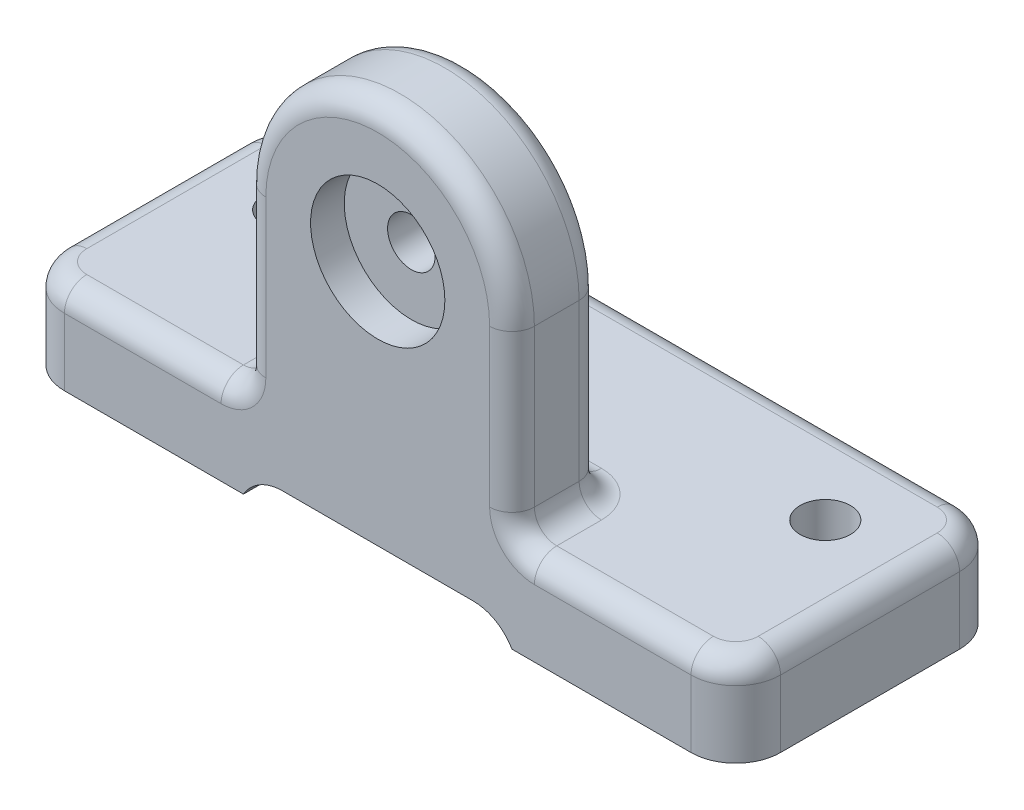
ISO-10303-21;
HEADER;
FILE_DESCRIPTION(('STEP AP214'),'2;1');
FILE_NAME('part.step','',(''),(''),'','','');
FILE_SCHEMA(('AUTOMOTIVE_DESIGN { 1 0 10303 214 1 1 1 1 }'));
ENDSEC;
DATA;
#1=APPLICATION_CONTEXT('core data for automotive mechanical design processes');
#2=APPLICATION_PROTOCOL_DEFINITION('international standard','automotive_design',2000,#1);
#3=PRODUCT_CONTEXT('',#1,'mechanical');
#4=PRODUCT('Part','Part','',(#3));
#5=PRODUCT_RELATED_PRODUCT_CATEGORY('part','',(#4));
#6=PRODUCT_DEFINITION_FORMATION('','',#4);
#7=PRODUCT_DEFINITION_CONTEXT('part definition',#1,'design');
#8=PRODUCT_DEFINITION('design','',#6,#7);
#9=PRODUCT_DEFINITION_SHAPE('','',#8);
#10=(LENGTH_UNIT() NAMED_UNIT(*) SI_UNIT(.MILLI.,.METRE.));
#11=(NAMED_UNIT(*) PLANE_ANGLE_UNIT() SI_UNIT($,.RADIAN.));
#12=(NAMED_UNIT(*) SI_UNIT($,.STERADIAN.) SOLID_ANGLE_UNIT());
#13=UNCERTAINTY_MEASURE_WITH_UNIT(LENGTH_MEASURE(1.E-05),#10,'distance_accuracy_value','');
#14=(GEOMETRIC_REPRESENTATION_CONTEXT(3) GLOBAL_UNCERTAINTY_ASSIGNED_CONTEXT((#13)) GLOBAL_UNIT_ASSIGNED_CONTEXT((#10,
#11,#12)) REPRESENTATION_CONTEXT('',''));
#15=CARTESIAN_POINT('',(0.,0.,0.));
#16=DIRECTION('',(0.,0.,1.));
#17=DIRECTION('',(1.,0.,0.));
#18=AXIS2_PLACEMENT_3D('',#15,#16,#17);
#19=CARTESIAN_POINT('',(0.,0.,-38.1));
#20=DIRECTION('',(0.,-1.,0.));
#21=DIRECTION('',(0.,0.,-1.));
#22=AXIS2_PLACEMENT_3D('',#19,#20,#21);
#23=PLANE('',#22);
#24=DIRECTION('',(-1.,0.,0.));
#25=VECTOR('',#24,1.);
#26=CARTESIAN_POINT('',(0.,0.,-38.1));
#27=LINE('',#26,#25);
#28=CARTESIAN_POINT('',(95.25,0.,-38.1));
#29=VERTEX_POINT('',#28);
#30=CARTESIAN_POINT('',(69.85,0.,-38.1));
#31=VERTEX_POINT('',#30);
#32=EDGE_CURVE('E270',#29,#31,#27,.T.);
#33=ORIENTED_EDGE('',*,*,#32,.F.);
#34=CARTESIAN_POINT('',(95.25,0.,-31.75));
#35=DIRECTION('',(0.,-1.,0.));
#36=DIRECTION('',(0.,0.,-1.));
#37=AXIS2_PLACEMENT_3D('',#34,#35,#36);
#38=CIRCLE('',#37,6.35);
#39=CARTESIAN_POINT('',(101.6,0.,-31.75));
#40=VERTEX_POINT('',#39);
#41=EDGE_CURVE('E298',#29,#40,#38,.T.);
#42=ORIENTED_EDGE('',*,*,#41,.T.);
#43=DIRECTION('',(0.,0.,-1.));
#44=VECTOR('',#43,1.);
#45=CARTESIAN_POINT('',(101.6,0.,0.));
#46=LINE('',#45,#44);
#47=CARTESIAN_POINT('',(101.6,0.,-6.35));
#48=VERTEX_POINT('',#47);
#49=EDGE_CURVE('E233',#48,#40,#46,.T.);
#50=ORIENTED_EDGE('',*,*,#49,.F.);
#51=CARTESIAN_POINT('',(95.25,0.,-6.35));
#52=DIRECTION('',(0.,-1.,0.));
#53=DIRECTION('',(0.,0.,-1.));
#54=AXIS2_PLACEMENT_3D('',#51,#52,#53);
#55=CIRCLE('',#54,6.35);
#56=CARTESIAN_POINT('',(95.25,0.,0.));
#57=VERTEX_POINT('',#56);
#58=EDGE_CURVE('E296',#48,#57,#55,.T.);
#59=ORIENTED_EDGE('',*,*,#58,.T.);
#60=DIRECTION('',(1.,0.,0.));
#61=VECTOR('',#60,1.);
#62=CARTESIAN_POINT('',(0.,0.,0.));
#63=LINE('',#62,#61);
#64=CARTESIAN_POINT('',(69.85,0.,0.));
#65=VERTEX_POINT('',#64);
#66=EDGE_CURVE('E234',#65,#57,#63,.T.);
#67=ORIENTED_EDGE('',*,*,#66,.F.);
#68=DIRECTION('',(0.,0.,1.));
#69=VECTOR('',#68,1.);
#70=CARTESIAN_POINT('',(69.85,0.,-38.1));
#71=LINE('',#70,#69);
#72=EDGE_CURVE('E241',#31,#65,#71,.T.);
#73=ORIENTED_EDGE('',*,*,#72,.F.);
#74=EDGE_LOOP('',(#33,#42,#50,#59,#67,#73));
#75=FACE_BOUND('',#74,.T.);
#76=CARTESIAN_POINT('',(88.9,0.,-25.4));
#77=DIRECTION('',(0.,1.,0.));
#78=DIRECTION('',(0.,0.,1.));
#79=AXIS2_PLACEMENT_3D('',#76,#77,#78);
#80=CIRCLE('',#79,3.571875);
#81=CARTESIAN_POINT('',(88.9,0.,-21.828125));
#82=VERTEX_POINT('',#81);
#83=EDGE_CURVE('E442',#82,#82,#80,.T.);
#84=ORIENTED_EDGE('',*,*,#83,.T.);
#85=EDGE_LOOP('',(#84));
#86=FACE_BOUND('',#85,.T.);
#87=ADVANCED_FACE('F30',(#75,#86),#23,.T.);
#88=CARTESIAN_POINT('',(6.35,0.,0.));
#89=VERTEX_POINT('',#88);
#90=CARTESIAN_POINT('',(31.75,0.,0.));
#91=VERTEX_POINT('',#90);
#92=EDGE_CURVE('E227',#89,#91,#63,.T.);
#93=ORIENTED_EDGE('',*,*,#92,.F.);
#94=CARTESIAN_POINT('',(6.35,0.,-6.35));
#95=DIRECTION('',(0.,-1.,0.));
#96=DIRECTION('',(0.,0.,-1.));
#97=AXIS2_PLACEMENT_3D('',#94,#95,#96);
#98=CIRCLE('',#97,6.35);
#99=CARTESIAN_POINT('',(0.,0.,-6.35));
#100=VERTEX_POINT('',#99);
#101=EDGE_CURVE('E284',#89,#100,#98,.T.);
#102=ORIENTED_EDGE('',*,*,#101,.T.);
#103=DIRECTION('',(0.,0.,1.));
#104=VECTOR('',#103,1.);
#105=CARTESIAN_POINT('',(0.,0.,0.));
#106=LINE('',#105,#104);
#107=CARTESIAN_POINT('',(0.,0.,-31.75));
#108=VERTEX_POINT('',#107);
#109=EDGE_CURVE('E263',#108,#100,#106,.T.);
#110=ORIENTED_EDGE('',*,*,#109,.F.);
#111=CARTESIAN_POINT('',(6.35,0.,-31.75));
#112=DIRECTION('',(0.,-1.,0.));
#113=DIRECTION('',(0.,0.,-1.));
#114=AXIS2_PLACEMENT_3D('',#111,#112,#113);
#115=CIRCLE('',#114,6.35);
#116=CARTESIAN_POINT('',(6.35,0.,-38.1));
#117=VERTEX_POINT('',#116);
#118=EDGE_CURVE('E282',#108,#117,#115,.T.);
#119=ORIENTED_EDGE('',*,*,#118,.T.);
#120=CARTESIAN_POINT('',(31.75,0.,-38.1));
#121=VERTEX_POINT('',#120);
#122=EDGE_CURVE('E240',#121,#117,#27,.T.);
#123=ORIENTED_EDGE('',*,*,#122,.F.);
#124=DIRECTION('',(0.,0.,1.));
#125=VECTOR('',#124,1.);
#126=CARTESIAN_POINT('',(31.75,0.,-38.1));
#127=LINE('',#126,#125);
#128=EDGE_CURVE('E218',#121,#91,#127,.T.);
#129=ORIENTED_EDGE('',*,*,#128,.T.);
#130=EDGE_LOOP('',(#93,#102,#110,#119,#123,#129));
#131=FACE_BOUND('',#130,.T.);
#132=CARTESIAN_POINT('',(12.7,0.,-25.4));
#133=DIRECTION('',(0.,1.,0.));
#134=DIRECTION('',(0.,0.,1.));
#135=AXIS2_PLACEMENT_3D('',#132,#133,#134);
#136=CIRCLE('',#135,3.571875);
#137=CARTESIAN_POINT('',(12.7,0.,-21.828125));
#138=VERTEX_POINT('',#137);
#139=EDGE_CURVE('E448',#138,#138,#136,.T.);
#140=ORIENTED_EDGE('',*,*,#139,.T.);
#141=EDGE_LOOP('',(#140));
#142=FACE_BOUND('',#141,.T.);
#143=ADVANCED_FACE('F237',(#131,#142),#23,.T.);
#144=CARTESIAN_POINT('',(0.,12.7,0.));
#145=DIRECTION('',(1.,0.,0.));
#146=DIRECTION('',(0.,0.,-1.));
#147=AXIS2_PLACEMENT_3D('',#144,#145,#146);
#148=PLANE('',#147);
#149=DIRECTION('',(0.,-1.,0.));
#150=VECTOR('',#149,1.);
#151=CARTESIAN_POINT('',(0.,12.7,-6.35));
#152=LINE('',#151,#150);
#153=CARTESIAN_POINT('',(0.,9.525,-6.35));
#154=VERTEX_POINT('',#153);
#155=EDGE_CURVE('E288',#100,#154,#152,.F.);
#156=ORIENTED_EDGE('',*,*,#155,.T.);
#157=DIRECTION('',(0.,0.,1.));
#158=VECTOR('',#157,1.);
#159=CARTESIAN_POINT('',(0.,9.525,0.));
#160=LINE('',#159,#158);
#161=CARTESIAN_POINT('',(0.,9.525,-31.75));
#162=VERTEX_POINT('',#161);
#163=EDGE_CURVE('E343',#154,#162,#160,.F.);
#164=ORIENTED_EDGE('',*,*,#163,.T.);
#165=DIRECTION('',(0.,-1.,0.));
#166=VECTOR('',#165,1.);
#167=CARTESIAN_POINT('',(0.,12.7,-31.75));
#168=LINE('',#167,#166);
#169=EDGE_CURVE('E286',#162,#108,#168,.T.);
#170=ORIENTED_EDGE('',*,*,#169,.T.);
#171=ORIENTED_EDGE('',*,*,#109,.T.);
#172=EDGE_LOOP('',(#156,#164,#170,#171));
#173=FACE_BOUND('',#172,.T.);
#174=ADVANCED_FACE('F32',(#173),#148,.F.);
#175=CARTESIAN_POINT('',(0.,12.7,0.));
#176=DIRECTION('',(0.,0.,-1.));
#177=DIRECTION('',(-1.,0.,0.));
#178=AXIS2_PLACEMENT_3D('',#175,#176,#177);
#179=PLANE('',#178);
#180=CARTESIAN_POINT('',(50.8,38.1,0.));
#181=DIRECTION('',(0.,0.,1.));
#182=DIRECTION('',(1.,0.,0.));
#183=AXIS2_PLACEMENT_3D('',#180,#181,#182);
#184=CIRCLE('',#183,9.52499999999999);
#185=CARTESIAN_POINT('',(60.325,38.1,0.));
#186=VERTEX_POINT('',#185);
#187=EDGE_CURVE('E256',#186,#186,#184,.T.);
#188=ORIENTED_EDGE('',*,*,#187,.F.);
#189=EDGE_LOOP('',(#188));
#190=FACE_BOUND('',#189,.T.);
#191=CARTESIAN_POINT('',(28.575,15.875,0.));
#192=DIRECTION('',(0.,0.,-1.));
#193=DIRECTION('',(-1.,0.,0.));
#194=AXIS2_PLACEMENT_3D('',#191,#192,#193);
#195=CIRCLE('',#194,6.35);
#196=CARTESIAN_POINT('',(28.575,9.525,0.));
#197=VERTEX_POINT('',#196);
#198=CARTESIAN_POINT('',(34.925,15.875,0.));
#199=VERTEX_POINT('',#198);
#200=EDGE_CURVE('E362',#197,#199,#195,.F.);
#201=ORIENTED_EDGE('',*,*,#200,.F.);
#202=DIRECTION('',(1.,0.,0.));
#203=VECTOR('',#202,1.);
#204=CARTESIAN_POINT('',(0.,9.525,0.));
#205=LINE('',#204,#203);
#206=CARTESIAN_POINT('',(6.35,9.525,0.));
#207=VERTEX_POINT('',#206);
#208=EDGE_CURVE('E365',#197,#207,#205,.F.);
#209=ORIENTED_EDGE('',*,*,#208,.T.);
#210=DIRECTION('',(0.,-1.,0.));
#211=VECTOR('',#210,1.);
#212=CARTESIAN_POINT('',(6.35,12.7,0.));
#213=LINE('',#212,#211);
#214=EDGE_CURVE('E230',#207,#89,#213,.T.);
#215=ORIENTED_EDGE('',*,*,#214,.T.);
#216=ORIENTED_EDGE('',*,*,#92,.T.);
#217=CARTESIAN_POINT('',(37.2492613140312,-3.175,0.));
#218=DIRECTION('',(0.,0.,-1.));
#219=DIRECTION('',(-1.,0.,0.));
#220=AXIS2_PLACEMENT_3D('',#217,#218,#219);
#221=CIRCLE('',#220,6.35);
#222=CARTESIAN_POINT('',(37.2492613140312,3.175,0.));
#223=VERTEX_POINT('',#222);
#224=EDGE_CURVE('E213',#91,#223,#221,.T.);
#225=ORIENTED_EDGE('',*,*,#224,.T.);
#226=DIRECTION('',(-1.,0.,0.));
#227=VECTOR('',#226,1.);
#228=CARTESIAN_POINT('',(31.75,3.175,0.));
#229=LINE('',#228,#227);
#230=CARTESIAN_POINT('',(64.3507386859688,3.175,0.));
#231=VERTEX_POINT('',#230);
#232=EDGE_CURVE('E248',#231,#223,#229,.T.);
#233=ORIENTED_EDGE('',*,*,#232,.F.);
#234=CARTESIAN_POINT('',(64.3507386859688,-3.175,0.));
#235=DIRECTION('',(0.,0.,-1.));
#236=DIRECTION('',(-1.,0.,0.));
#237=AXIS2_PLACEMENT_3D('',#234,#235,#236);
#238=CIRCLE('',#237,6.35);
#239=EDGE_CURVE('E305',#231,#65,#238,.T.);
#240=ORIENTED_EDGE('',*,*,#239,.T.);
#241=ORIENTED_EDGE('',*,*,#66,.T.);
#242=DIRECTION('',(0.,-1.,0.));
#243=VECTOR('',#242,1.);
#244=CARTESIAN_POINT('',(95.25,12.7,0.));
#245=LINE('',#244,#243);
#246=CARTESIAN_POINT('',(95.25,9.525,0.));
#247=VERTEX_POINT('',#246);
#248=EDGE_CURVE('E278',#57,#247,#245,.F.);
#249=ORIENTED_EDGE('',*,*,#248,.T.);
#250=DIRECTION('',(1.,0.,0.));
#251=VECTOR('',#250,1.);
#252=CARTESIAN_POINT('',(0.,9.525,0.));
#253=LINE('',#252,#251);
#254=CARTESIAN_POINT('',(73.025,9.525,0.));
#255=VERTEX_POINT('',#254);
#256=EDGE_CURVE('E360',#247,#255,#253,.F.);
#257=ORIENTED_EDGE('',*,*,#256,.T.);
#258=CARTESIAN_POINT('',(73.025,15.875,0.));
#259=DIRECTION('',(0.,0.,-1.));
#260=DIRECTION('',(-1.,0.,0.));
#261=AXIS2_PLACEMENT_3D('',#258,#259,#260);
#262=CIRCLE('',#261,6.35);
#263=CARTESIAN_POINT('',(66.675,15.875,0.));
#264=VERTEX_POINT('',#263);
#265=EDGE_CURVE('E357',#264,#255,#262,.F.);
#266=ORIENTED_EDGE('',*,*,#265,.F.);
#267=DIRECTION('',(0.,1.,0.));
#268=VECTOR('',#267,1.);
#269=CARTESIAN_POINT('',(66.675,38.1,0.));
#270=LINE('',#269,#268);
#271=CARTESIAN_POINT('',(66.675,38.1,0.));
#272=VERTEX_POINT('',#271);
#273=EDGE_CURVE('E355',#264,#272,#270,.T.);
#274=ORIENTED_EDGE('',*,*,#273,.T.);
#275=CARTESIAN_POINT('',(50.8,38.1,0.));
#276=DIRECTION('',(0.,0.,-1.));
#277=DIRECTION('',(-1.,0.,0.));
#278=AXIS2_PLACEMENT_3D('',#275,#276,#277);
#279=CIRCLE('',#278,15.875);
#280=CARTESIAN_POINT('',(34.925,38.1,0.));
#281=VERTEX_POINT('',#280);
#282=EDGE_CURVE('E351',#272,#281,#279,.F.);
#283=ORIENTED_EDGE('',*,*,#282,.T.);
#284=DIRECTION('',(0.,-1.,0.));
#285=VECTOR('',#284,1.);
#286=CARTESIAN_POINT('',(34.925,12.7,0.));
#287=LINE('',#286,#285);
#288=EDGE_CURVE('E353',#281,#199,#287,.T.);
#289=ORIENTED_EDGE('',*,*,#288,.T.);
#290=EDGE_LOOP('',(#201,#209,#215,#216,#225,#233,#240,#241,#249,#257,#266,#274,#283,#289));
#291=FACE_BOUND('',#290,.T.);
#292=ADVANCED_FACE('F228',(#190,#291),#179,.F.);
#293=CARTESIAN_POINT('',(101.6,12.7,0.));
#294=DIRECTION('',(-1.,0.,0.));
#295=DIRECTION('',(0.,0.,1.));
#296=AXIS2_PLACEMENT_3D('',#293,#294,#295);
#297=PLANE('',#296);
#298=DIRECTION('',(0.,-1.,0.));
#299=VECTOR('',#298,1.);
#300=CARTESIAN_POINT('',(101.6,12.7,-31.75));
#301=LINE('',#300,#299);
#302=CARTESIAN_POINT('',(101.6,9.525,-31.75));
#303=VERTEX_POINT('',#302);
#304=EDGE_CURVE('E302',#40,#303,#301,.F.);
#305=ORIENTED_EDGE('',*,*,#304,.T.);
#306=DIRECTION('',(0.,0.,-1.));
#307=VECTOR('',#306,1.);
#308=CARTESIAN_POINT('',(101.6,9.525,0.));
#309=LINE('',#308,#307);
#310=CARTESIAN_POINT('',(101.6,9.525,-6.35));
#311=VERTEX_POINT('',#310);
#312=EDGE_CURVE('E367',#303,#311,#309,.F.);
#313=ORIENTED_EDGE('',*,*,#312,.T.);
#314=DIRECTION('',(0.,-1.,0.));
#315=VECTOR('',#314,1.);
#316=CARTESIAN_POINT('',(101.6,12.7,-6.35));
#317=LINE('',#316,#315);
#318=EDGE_CURVE('E300',#311,#48,#317,.T.);
#319=ORIENTED_EDGE('',*,*,#318,.T.);
#320=ORIENTED_EDGE('',*,*,#49,.T.);
#321=EDGE_LOOP('',(#305,#313,#319,#320));
#322=FACE_BOUND('',#321,.T.);
#323=ADVANCED_FACE('F477',(#322),#297,.F.);
#324=CARTESIAN_POINT('',(0.,12.7,-38.1));
#325=DIRECTION('',(0.,0.,1.));
#326=DIRECTION('',(1.,0.,0.));
#327=AXIS2_PLACEMENT_3D('',#324,#325,#326);
#328=PLANE('',#327);
#329=DIRECTION('',(0.,-1.,0.));
#330=VECTOR('',#329,1.);
#331=CARTESIAN_POINT('',(6.35,12.7,-38.1));
#332=LINE('',#331,#330);
#333=CARTESIAN_POINT('',(6.35,9.525,-38.1));
#334=VERTEX_POINT('',#333);
#335=EDGE_CURVE('E293',#117,#334,#332,.F.);
#336=ORIENTED_EDGE('',*,*,#335,.T.);
#337=DIRECTION('',(-1.,0.,0.));
#338=VECTOR('',#337,1.);
#339=CARTESIAN_POINT('',(0.,9.525,-38.1));
#340=LINE('',#339,#338);
#341=CARTESIAN_POINT('',(95.25,9.525,-38.1));
#342=VERTEX_POINT('',#341);
#343=EDGE_CURVE('E345',#334,#342,#340,.F.);
#344=ORIENTED_EDGE('',*,*,#343,.T.);
#345=DIRECTION('',(0.,-1.,0.));
#346=VECTOR('',#345,1.);
#347=CARTESIAN_POINT('',(95.25,12.7,-38.1));
#348=LINE('',#347,#346);
#349=EDGE_CURVE('E291',#342,#29,#348,.T.);
#350=ORIENTED_EDGE('',*,*,#349,.T.);
#351=ORIENTED_EDGE('',*,*,#32,.T.);
#352=CARTESIAN_POINT('',(64.3507386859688,-3.175,-38.1));
#353=DIRECTION('',(0.,0.,1.));
#354=DIRECTION('',(1.,0.,0.));
#355=AXIS2_PLACEMENT_3D('',#352,#353,#354);
#356=CIRCLE('',#355,6.35);
#357=CARTESIAN_POINT('',(64.3507386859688,3.175,-38.1));
#358=VERTEX_POINT('',#357);
#359=EDGE_CURVE('E224',#31,#358,#356,.T.);
#360=ORIENTED_EDGE('',*,*,#359,.T.);
#361=DIRECTION('',(-1.,0.,0.));
#362=VECTOR('',#361,1.);
#363=CARTESIAN_POINT('',(31.75,3.175,-38.1));
#364=LINE('',#363,#362);
#365=CARTESIAN_POINT('',(37.2492613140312,3.175,-38.1));
#366=VERTEX_POINT('',#365);
#367=EDGE_CURVE('E242',#358,#366,#364,.T.);
#368=ORIENTED_EDGE('',*,*,#367,.T.);
#369=CARTESIAN_POINT('',(37.2492613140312,-3.175,-38.1));
#370=DIRECTION('',(0.,0.,1.));
#371=DIRECTION('',(1.,0.,0.));
#372=AXIS2_PLACEMENT_3D('',#369,#370,#371);
#373=CIRCLE('',#372,6.35);
#374=EDGE_CURVE('E223',#366,#121,#373,.T.);
#375=ORIENTED_EDGE('',*,*,#374,.T.);
#376=ORIENTED_EDGE('',*,*,#122,.T.);
#377=EDGE_LOOP('',(#336,#344,#350,#351,#360,#368,#375,#376));
#378=FACE_BOUND('',#377,.T.);
#379=ADVANCED_FACE('F471',(#378),#328,.F.);
#380=CARTESIAN_POINT('',(0.,12.7,-38.1));
#381=DIRECTION('',(0.,-1.,0.));
#382=DIRECTION('',(0.,0.,-1.));
#383=AXIS2_PLACEMENT_3D('',#380,#381,#382);
#384=PLANE('',#383);
#385=DIRECTION('',(-1.,0.,0.));
#386=VECTOR('',#385,1.);
#387=CARTESIAN_POINT('',(0.,12.7,-34.925));
#388=LINE('',#387,#386);
#389=CARTESIAN_POINT('',(95.25,12.7,-34.925));
#390=VERTEX_POINT('',#389);
#391=CARTESIAN_POINT('',(6.35,12.7,-34.925));
#392=VERTEX_POINT('',#391);
#393=EDGE_CURVE('E333',#390,#392,#388,.T.);
#394=ORIENTED_EDGE('',*,*,#393,.T.);
#395=CARTESIAN_POINT('',(6.35,12.7,-31.75));
#396=DIRECTION('',(0.,-1.,0.));
#397=DIRECTION('',(0.,0.,-1.));
#398=AXIS2_PLACEMENT_3D('',#395,#396,#397);
#399=CIRCLE('',#398,3.175);
#400=CARTESIAN_POINT('',(3.175,12.7,-31.75));
#401=VERTEX_POINT('',#400);
#402=EDGE_CURVE('E337',#392,#401,#399,.F.);
#403=ORIENTED_EDGE('',*,*,#402,.T.);
#404=DIRECTION('',(0.,0.,1.));
#405=VECTOR('',#404,1.);
#406=CARTESIAN_POINT('',(3.175,12.7,-38.1));
#407=LINE('',#406,#405);
#408=CARTESIAN_POINT('',(3.175,12.7,-6.35));
#409=VERTEX_POINT('',#408);
#410=EDGE_CURVE('E335',#401,#409,#407,.T.);
#411=ORIENTED_EDGE('',*,*,#410,.T.);
#412=CARTESIAN_POINT('',(6.35,12.7,-6.35));
#413=DIRECTION('',(0.,-1.,0.));
#414=DIRECTION('',(0.,0.,-1.));
#415=AXIS2_PLACEMENT_3D('',#412,#413,#414);
#416=CIRCLE('',#415,3.175);
#417=CARTESIAN_POINT('',(6.35,12.7,-3.175));
#418=VERTEX_POINT('',#417);
#419=EDGE_CURVE('E331',#409,#418,#416,.F.);
#420=ORIENTED_EDGE('',*,*,#419,.T.);
#421=DIRECTION('',(1.,0.,0.));
#422=VECTOR('',#421,1.);
#423=CARTESIAN_POINT('',(0.,12.7,-3.175));
#424=LINE('',#423,#422);
#425=CARTESIAN_POINT('',(28.575,12.7,-3.175));
#426=VERTEX_POINT('',#425);
#427=EDGE_CURVE('E327',#418,#426,#424,.T.);
#428=ORIENTED_EDGE('',*,*,#427,.T.);
#429=DIRECTION('',(0.,0.,-1.));
#430=VECTOR('',#429,1.);
#431=CARTESIAN_POINT('',(28.575,12.7,-38.1));
#432=LINE('',#431,#430);
#433=CARTESIAN_POINT('',(28.575,12.7,-9.525));
#434=VERTEX_POINT('',#433);
#435=EDGE_CURVE('E323',#426,#434,#432,.T.);
#436=ORIENTED_EDGE('',*,*,#435,.T.);
#437=CARTESIAN_POINT('',(34.925,12.7,-9.525));
#438=DIRECTION('',(0.,-1.,0.));
#439=DIRECTION('',(0.,0.,-1.));
#440=AXIS2_PLACEMENT_3D('',#437,#438,#439);
#441=CIRCLE('',#440,6.35);
#442=CARTESIAN_POINT('',(34.925,12.7,-15.875));
#443=VERTEX_POINT('',#442);
#444=EDGE_CURVE('E320',#443,#434,#441,.F.);
#445=ORIENTED_EDGE('',*,*,#444,.F.);
#446=DIRECTION('',(1.,0.,0.));
#447=VECTOR('',#446,1.);
#448=CARTESIAN_POINT('',(0.,12.7,-15.875));
#449=LINE('',#448,#447);
#450=CARTESIAN_POINT('',(66.675,12.7,-15.875));
#451=VERTEX_POINT('',#450);
#452=EDGE_CURVE('E316',#443,#451,#449,.T.);
#453=ORIENTED_EDGE('',*,*,#452,.T.);
#454=CARTESIAN_POINT('',(66.675,12.7,-9.525));
#455=DIRECTION('',(0.,-1.,0.));
#456=DIRECTION('',(0.,0.,-1.));
#457=AXIS2_PLACEMENT_3D('',#454,#455,#456);
#458=CIRCLE('',#457,6.35);
#459=CARTESIAN_POINT('',(73.025,12.7,-9.525));
#460=VERTEX_POINT('',#459);
#461=EDGE_CURVE('E313',#460,#451,#458,.F.);
#462=ORIENTED_EDGE('',*,*,#461,.F.);
#463=DIRECTION('',(0.,0.,1.));
#464=VECTOR('',#463,1.);
#465=CARTESIAN_POINT('',(73.025,12.7,-38.1));
#466=LINE('',#465,#464);
#467=CARTESIAN_POINT('',(73.025,12.7,-3.175));
#468=VERTEX_POINT('',#467);
#469=EDGE_CURVE('E309',#460,#468,#466,.T.);
#470=ORIENTED_EDGE('',*,*,#469,.T.);
#471=DIRECTION('',(1.,0.,0.));
#472=VECTOR('',#471,1.);
#473=CARTESIAN_POINT('',(0.,12.7,-3.175));
#474=LINE('',#473,#472);
#475=CARTESIAN_POINT('',(95.25,12.7,-3.175));
#476=VERTEX_POINT('',#475);
#477=EDGE_CURVE('E311',#468,#476,#474,.T.);
#478=ORIENTED_EDGE('',*,*,#477,.T.);
#479=CARTESIAN_POINT('',(95.25,12.7,-6.35));
#480=DIRECTION('',(0.,-1.,0.));
#481=DIRECTION('',(0.,0.,-1.));
#482=AXIS2_PLACEMENT_3D('',#479,#480,#481);
#483=CIRCLE('',#482,3.175);
#484=CARTESIAN_POINT('',(98.425,12.7,-6.35));
#485=VERTEX_POINT('',#484);
#486=EDGE_CURVE('E318',#476,#485,#483,.F.);
#487=ORIENTED_EDGE('',*,*,#486,.T.);
#488=DIRECTION('',(0.,0.,-1.));
#489=VECTOR('',#488,1.);
#490=CARTESIAN_POINT('',(98.425,12.7,-38.1));
#491=LINE('',#490,#489);
#492=CARTESIAN_POINT('',(98.425,12.7,-31.75));
#493=VERTEX_POINT('',#492);
#494=EDGE_CURVE('E325',#485,#493,#491,.T.);
#495=ORIENTED_EDGE('',*,*,#494,.T.);
#496=CARTESIAN_POINT('',(95.25,12.7,-31.75));
#497=DIRECTION('',(0.,-1.,0.));
#498=DIRECTION('',(0.,0.,-1.));
#499=AXIS2_PLACEMENT_3D('',#496,#497,#498);
#500=CIRCLE('',#499,3.175);
#501=EDGE_CURVE('E329',#493,#390,#500,.F.);
#502=ORIENTED_EDGE('',*,*,#501,.T.);
#503=EDGE_LOOP('',(#394,#403,#411,#420,#428,#436,#445,#453,#462,#470,#478,#487,#495,#502));
#504=FACE_BOUND('',#503,.T.);
#505=CARTESIAN_POINT('',(88.9,12.7,-25.4));
#506=DIRECTION('',(0.,1.,0.));
#507=DIRECTION('',(0.,0.,1.));
#508=AXIS2_PLACEMENT_3D('',#505,#506,#507);
#509=CIRCLE('',#508,3.57187499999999);
#510=CARTESIAN_POINT('',(88.9,12.7,-21.828125));
#511=VERTEX_POINT('',#510);
#512=EDGE_CURVE('E445',#511,#511,#509,.T.);
#513=ORIENTED_EDGE('',*,*,#512,.F.);
#514=EDGE_LOOP('',(#513));
#515=FACE_BOUND('',#514,.T.);
#516=CARTESIAN_POINT('',(12.7,12.7,-25.4));
#517=DIRECTION('',(0.,1.,0.));
#518=DIRECTION('',(0.,0.,1.));
#519=AXIS2_PLACEMENT_3D('',#516,#517,#518);
#520=CIRCLE('',#519,3.57187499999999);
#521=CARTESIAN_POINT('',(12.7,12.7,-21.828125));
#522=VERTEX_POINT('',#521);
#523=EDGE_CURVE('E451',#522,#522,#520,.T.);
#524=ORIENTED_EDGE('',*,*,#523,.F.);
#525=EDGE_LOOP('',(#524));
#526=FACE_BOUND('',#525,.T.);
#527=ADVANCED_FACE('F535',(#504,#515,#526),#384,.F.);
#528=CARTESIAN_POINT('',(31.75,0.,-12.7));
#529=DIRECTION('',(-1.,0.,0.));
#530=DIRECTION('',(0.,-1.,0.));
#531=AXIS2_PLACEMENT_3D('',#528,#529,#530);
#532=PLANE('',#531);
#533=DIRECTION('',(0.,0.,1.));
#534=VECTOR('',#533,1.);
#535=CARTESIAN_POINT('',(31.75,38.1,-12.7));
#536=LINE('',#535,#534);
#537=CARTESIAN_POINT('',(31.75,38.1,-9.525));
#538=VERTEX_POINT('',#537);
#539=CARTESIAN_POINT('',(31.75,38.1,-3.175));
#540=VERTEX_POINT('',#539);
#541=EDGE_CURVE('E260',#538,#540,#536,.T.);
#542=ORIENTED_EDGE('',*,*,#541,.F.);
#543=DIRECTION('',(0.,-1.,0.));
#544=VECTOR('',#543,1.);
#545=CARTESIAN_POINT('',(31.75,0.,-9.525));
#546=LINE('',#545,#544);
#547=CARTESIAN_POINT('',(31.75,15.875,-9.525));
#548=VERTEX_POINT('',#547);
#549=EDGE_CURVE('E374',#538,#548,#546,.T.);
#550=ORIENTED_EDGE('',*,*,#549,.T.);
#551=DIRECTION('',(0.,0.,-1.));
#552=VECTOR('',#551,1.);
#553=CARTESIAN_POINT('',(31.75,15.875,-12.7));
#554=LINE('',#553,#552);
#555=CARTESIAN_POINT('',(31.75,15.875,-3.175));
#556=VERTEX_POINT('',#555);
#557=EDGE_CURVE('E371',#548,#556,#554,.F.);
#558=ORIENTED_EDGE('',*,*,#557,.T.);
#559=DIRECTION('',(0.,-1.,0.));
#560=VECTOR('',#559,1.);
#561=CARTESIAN_POINT('',(31.75,38.1,-3.175));
#562=LINE('',#561,#560);
#563=EDGE_CURVE('E369',#556,#540,#562,.F.);
#564=ORIENTED_EDGE('',*,*,#563,.T.);
#565=EDGE_LOOP('',(#542,#550,#558,#564));
#566=FACE_BOUND('',#565,.T.);
#567=ADVANCED_FACE('F623',(#566),#532,.T.);
#568=CARTESIAN_POINT('',(69.85,38.1,-12.7));
#569=DIRECTION('',(1.,0.,0.));
#570=DIRECTION('',(0.,0.,-1.));
#571=AXIS2_PLACEMENT_3D('',#568,#569,#570);
#572=PLANE('',#571);
#573=DIRECTION('',(0.,0.,1.));
#574=VECTOR('',#573,1.);
#575=CARTESIAN_POINT('',(69.85,15.875,-12.7));
#576=LINE('',#575,#574);
#577=CARTESIAN_POINT('',(69.85,15.875,-3.175));
#578=VERTEX_POINT('',#577);
#579=CARTESIAN_POINT('',(69.85,15.875,-9.525));
#580=VERTEX_POINT('',#579);
#581=EDGE_CURVE('E45',#578,#580,#576,.F.);
#582=ORIENTED_EDGE('',*,*,#581,.T.);
#583=DIRECTION('',(0.,1.,0.));
#584=VECTOR('',#583,1.);
#585=CARTESIAN_POINT('',(69.85,38.1,-9.525));
#586=LINE('',#585,#584);
#587=CARTESIAN_POINT('',(69.85,38.1,-9.525));
#588=VERTEX_POINT('',#587);
#589=EDGE_CURVE('E389',#580,#588,#586,.T.);
#590=ORIENTED_EDGE('',*,*,#589,.T.);
#591=DIRECTION('',(0.,0.,1.));
#592=VECTOR('',#591,1.);
#593=CARTESIAN_POINT('',(69.85,38.1,-12.7));
#594=LINE('',#593,#592);
#595=CARTESIAN_POINT('',(69.85,38.1,-3.175));
#596=VERTEX_POINT('',#595);
#597=EDGE_CURVE('E264',#588,#596,#594,.T.);
#598=ORIENTED_EDGE('',*,*,#597,.T.);
#599=DIRECTION('',(0.,1.,0.));
#600=VECTOR('',#599,1.);
#601=CARTESIAN_POINT('',(69.85,12.7,-3.175));
#602=LINE('',#601,#600);
#603=EDGE_CURVE('E50',#596,#578,#602,.F.);
#604=ORIENTED_EDGE('',*,*,#603,.T.);
#605=EDGE_LOOP('',(#582,#590,#598,#604));
#606=FACE_BOUND('',#605,.T.);
#607=ADVANCED_FACE('F400',(#606),#572,.T.);
#608=CARTESIAN_POINT('',(50.8,38.1,-12.7));
#609=DIRECTION('',(0.,0.,-1.));
#610=DIRECTION('',(-1.,0.,0.));
#611=AXIS2_PLACEMENT_3D('',#608,#609,#610);
#612=PLANE('',#611);
#613=DIRECTION('',(0.,1.,0.));
#614=VECTOR('',#613,1.);
#615=CARTESIAN_POINT('',(66.675,38.1,-12.7));
#616=LINE('',#615,#614);
#617=CARTESIAN_POINT('',(66.675,38.1,-12.7));
#618=VERTEX_POINT('',#617);
#619=CARTESIAN_POINT('',(66.675,15.875,-12.7));
#620=VERTEX_POINT('',#619);
#621=EDGE_CURVE('E382',#618,#620,#616,.F.);
#622=ORIENTED_EDGE('',*,*,#621,.T.);
#623=DIRECTION('',(1.,0.,0.));
#624=VECTOR('',#623,1.);
#625=CARTESIAN_POINT('',(50.8,15.875,-12.7));
#626=LINE('',#625,#624);
#627=CARTESIAN_POINT('',(34.925,15.875,-12.7));
#628=VERTEX_POINT('',#627);
#629=EDGE_CURVE('E384',#620,#628,#626,.F.);
#630=ORIENTED_EDGE('',*,*,#629,.T.);
#631=DIRECTION('',(0.,-1.,0.));
#632=VECTOR('',#631,1.);
#633=CARTESIAN_POINT('',(34.925,38.1,-12.7));
#634=LINE('',#633,#632);
#635=CARTESIAN_POINT('',(34.925,38.1,-12.7));
#636=VERTEX_POINT('',#635);
#637=EDGE_CURVE('E380',#628,#636,#634,.F.);
#638=ORIENTED_EDGE('',*,*,#637,.T.);
#639=CARTESIAN_POINT('',(50.8,38.1,-12.7));
#640=DIRECTION('',(0.,0.,-1.));
#641=DIRECTION('',(-1.,0.,0.));
#642=AXIS2_PLACEMENT_3D('',#639,#640,#641);
#643=CIRCLE('',#642,15.875);
#644=EDGE_CURVE('E378',#636,#618,#643,.T.);
#645=ORIENTED_EDGE('',*,*,#644,.T.);
#646=EDGE_LOOP('',(#622,#630,#638,#645));
#647=FACE_BOUND('',#646,.T.);
#648=CARTESIAN_POINT('',(50.8,38.1,-12.7));
#649=DIRECTION('',(0.,0.,-1.));
#650=DIRECTION('',(-1.,0.,0.));
#651=AXIS2_PLACEMENT_3D('',#648,#649,#650);
#652=CIRCLE('',#651,3.37819999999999);
#653=CARTESIAN_POINT('',(47.4218,38.1,-12.7));
#654=VERTEX_POINT('',#653);
#655=EDGE_CURVE('E259',#654,#654,#652,.T.);
#656=ORIENTED_EDGE('',*,*,#655,.F.);
#657=EDGE_LOOP('',(#656));
#658=FACE_BOUND('',#657,.T.);
#659=ADVANCED_FACE('F646',(#647,#658),#612,.T.);
#660=CARTESIAN_POINT('',(50.8,38.1,-12.7));
#661=DIRECTION('',(0.,0.,1.));
#662=DIRECTION('',(1.,0.,0.));
#663=AXIS2_PLACEMENT_3D('',#660,#661,#662);
#664=CYLINDRICAL_SURFACE('',#663,19.05);
#665=ORIENTED_EDGE('',*,*,#597,.F.);
#666=CARTESIAN_POINT('',(50.8,38.1,-9.525));
#667=DIRECTION('',(0.,0.,-1.));
#668=DIRECTION('',(-1.,0.,0.));
#669=AXIS2_PLACEMENT_3D('',#666,#667,#668);
#670=CIRCLE('',#669,19.05);
#671=EDGE_CURVE('E11',#588,#538,#670,.F.);
#672=ORIENTED_EDGE('',*,*,#671,.T.);
#673=ORIENTED_EDGE('',*,*,#541,.T.);
#674=CARTESIAN_POINT('',(50.8,38.1,-3.175));
#675=DIRECTION('',(0.,0.,-1.));
#676=DIRECTION('',(-1.,0.,0.));
#677=AXIS2_PLACEMENT_3D('',#674,#675,#676);
#678=CIRCLE('',#677,19.05);
#679=EDGE_CURVE('E38',#540,#596,#678,.T.);
#680=ORIENTED_EDGE('',*,*,#679,.T.);
#681=EDGE_LOOP('',(#665,#672,#673,#680));
#682=FACE_BOUND('',#681,.T.);
#683=ADVANCED_FACE('F393',(#682),#664,.T.);
#684=CARTESIAN_POINT('',(50.8,38.1,0.));
#685=DIRECTION('',(0.,0.,1.));
#686=DIRECTION('',(1.,0.,0.));
#687=AXIS2_PLACEMENT_3D('',#684,#685,#686);
#688=CYLINDRICAL_SURFACE('',#687,9.52499999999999);
#689=CARTESIAN_POINT('',(50.8,38.1,-4.7752));
#690=DIRECTION('',(0.,0.,1.));
#691=DIRECTION('',(1.,0.,0.));
#692=AXIS2_PLACEMENT_3D('',#689,#690,#691);
#693=CIRCLE('',#692,9.52499999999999);
#694=CARTESIAN_POINT('',(60.325,38.1,-4.7752));
#695=VERTEX_POINT('',#694);
#696=EDGE_CURVE('E253',#695,#695,#693,.T.);
#697=ORIENTED_EDGE('',*,*,#696,.F.);
#698=EDGE_LOOP('',(#697));
#699=FACE_BOUND('',#698,.T.);
#700=ORIENTED_EDGE('',*,*,#187,.T.);
#701=EDGE_LOOP('',(#700));
#702=FACE_BOUND('',#701,.T.);
#703=ADVANCED_FACE('F634',(#699,#702),#688,.F.);
#704=CARTESIAN_POINT('',(54.1782,38.1,-4.7752));
#705=DIRECTION('',(0.,0.,-1.));
#706=DIRECTION('',(-1.,0.,0.));
#707=AXIS2_PLACEMENT_3D('',#704,#705,#706);
#708=PLANE('',#707);
#709=CARTESIAN_POINT('',(50.8,38.1,-4.7752));
#710=DIRECTION('',(0.,0.,1.));
#711=DIRECTION('',(1.,0.,0.));
#712=AXIS2_PLACEMENT_3D('',#709,#710,#711);
#713=CIRCLE('',#712,3.3782);
#714=CARTESIAN_POINT('',(54.1782,38.1,-4.7752));
#715=VERTEX_POINT('',#714);
#716=EDGE_CURVE('E245',#715,#715,#713,.T.);
#717=ORIENTED_EDGE('',*,*,#716,.F.);
#718=EDGE_LOOP('',(#717));
#719=FACE_BOUND('',#718,.T.);
#720=ORIENTED_EDGE('',*,*,#696,.T.);
#721=EDGE_LOOP('',(#720));
#722=FACE_BOUND('',#721,.T.);
#723=ADVANCED_FACE('F636',(#719,#722),#708,.F.);
#724=CARTESIAN_POINT('',(50.8,38.1,0.));
#725=DIRECTION('',(0.,0.,1.));
#726=DIRECTION('',(1.,0.,0.));
#727=AXIS2_PLACEMENT_3D('',#724,#725,#726);
#728=CYLINDRICAL_SURFACE('',#727,3.37819999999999);
#729=ORIENTED_EDGE('',*,*,#655,.T.);
#730=EDGE_LOOP('',(#729));
#731=FACE_BOUND('',#730,.T.);
#732=ORIENTED_EDGE('',*,*,#716,.T.);
#733=EDGE_LOOP('',(#732));
#734=FACE_BOUND('',#733,.T.);
#735=ADVANCED_FACE('F643',(#731,#734),#728,.F.);
#736=CARTESIAN_POINT('',(31.75,3.175,-38.1));
#737=DIRECTION('',(0.,1.,0.));
#738=DIRECTION('',(0.,0.,1.));
#739=AXIS2_PLACEMENT_3D('',#736,#737,#738);
#740=PLANE('',#739);
#741=ORIENTED_EDGE('',*,*,#367,.F.);
#742=DIRECTION('',(0.,0.,-1.));
#743=VECTOR('',#742,1.);
#744=CARTESIAN_POINT('',(64.3507386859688,3.175,-38.1));
#745=LINE('',#744,#743);
#746=EDGE_CURVE('E275',#358,#231,#745,.F.);
#747=ORIENTED_EDGE('',*,*,#746,.T.);
#748=ORIENTED_EDGE('',*,*,#232,.T.);
#749=DIRECTION('',(0.,0.,1.));
#750=VECTOR('',#749,1.);
#751=CARTESIAN_POINT('',(37.2492613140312,3.175,-38.1));
#752=LINE('',#751,#750);
#753=EDGE_CURVE('E219',#223,#366,#752,.F.);
#754=ORIENTED_EDGE('',*,*,#753,.T.);
#755=EDGE_LOOP('',(#741,#747,#748,#754));
#756=FACE_BOUND('',#755,.T.);
#757=ADVANCED_FACE('F456',(#756),#740,.F.);
#758=CARTESIAN_POINT('',(12.7,12.7,-25.4));
#759=DIRECTION('',(0.,1.,0.));
#760=DIRECTION('',(0.,0.,1.));
#761=AXIS2_PLACEMENT_3D('',#758,#759,#760);
#762=CYLINDRICAL_SURFACE('',#761,3.57187499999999);
#763=ORIENTED_EDGE('',*,*,#139,.F.);
#764=EDGE_LOOP('',(#763));
#765=FACE_BOUND('',#764,.T.);
#766=ORIENTED_EDGE('',*,*,#523,.T.);
#767=EDGE_LOOP('',(#766));
#768=FACE_BOUND('',#767,.T.);
#769=ADVANCED_FACE('F693',(#765,#768),#762,.F.);
#770=CARTESIAN_POINT('',(88.9,12.7,-25.4));
#771=DIRECTION('',(0.,1.,0.));
#772=DIRECTION('',(0.,0.,1.));
#773=AXIS2_PLACEMENT_3D('',#770,#771,#772);
#774=CYLINDRICAL_SURFACE('',#773,3.571875);
#775=ORIENTED_EDGE('',*,*,#83,.F.);
#776=EDGE_LOOP('',(#775));
#777=FACE_BOUND('',#776,.T.);
#778=ORIENTED_EDGE('',*,*,#512,.T.);
#779=EDGE_LOOP('',(#778));
#780=FACE_BOUND('',#779,.T.);
#781=ADVANCED_FACE('F690',(#777,#780),#774,.F.);
#782=CARTESIAN_POINT('',(64.3507386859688,-3.175,-38.1));
#783=DIRECTION('',(0.,0.,-1.));
#784=DIRECTION('',(-1.,0.,0.));
#785=AXIS2_PLACEMENT_3D('',#782,#783,#784);
#786=CYLINDRICAL_SURFACE('',#785,6.35);
#787=ORIENTED_EDGE('',*,*,#359,.F.);
#788=ORIENTED_EDGE('',*,*,#72,.T.);
#789=ORIENTED_EDGE('',*,*,#239,.F.);
#790=ORIENTED_EDGE('',*,*,#746,.F.);
#791=EDGE_LOOP('',(#787,#788,#789,#790));
#792=FACE_BOUND('',#791,.T.);
#793=ADVANCED_FACE('F469',(#792),#786,.F.);
#794=CARTESIAN_POINT('',(37.2492613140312,-3.175,-38.1));
#795=DIRECTION('',(0.,0.,1.));
#796=DIRECTION('',(1.,0.,0.));
#797=AXIS2_PLACEMENT_3D('',#794,#795,#796);
#798=CYLINDRICAL_SURFACE('',#797,6.35);
#799=ORIENTED_EDGE('',*,*,#374,.F.);
#800=ORIENTED_EDGE('',*,*,#753,.F.);
#801=ORIENTED_EDGE('',*,*,#224,.F.);
#802=ORIENTED_EDGE('',*,*,#128,.F.);
#803=EDGE_LOOP('',(#799,#800,#801,#802));
#804=FACE_BOUND('',#803,.T.);
#805=ADVANCED_FACE('F216',(#804),#798,.F.);
#806=CARTESIAN_POINT('',(6.35,12.7,-6.35));
#807=DIRECTION('',(0.,-1.,0.));
#808=DIRECTION('',(0.,0.,-1.));
#809=AXIS2_PLACEMENT_3D('',#806,#807,#808);
#810=CYLINDRICAL_SURFACE('',#809,6.35);
#811=ORIENTED_EDGE('',*,*,#214,.F.);
#812=CARTESIAN_POINT('',(6.35,9.525,-6.35));
#813=DIRECTION('',(0.,-1.,0.));
#814=DIRECTION('',(0.,0.,-1.));
#815=AXIS2_PLACEMENT_3D('',#812,#813,#814);
#816=CIRCLE('',#815,6.35);
#817=EDGE_CURVE('E347',#207,#154,#816,.T.);
#818=ORIENTED_EDGE('',*,*,#817,.T.);
#819=ORIENTED_EDGE('',*,*,#155,.F.);
#820=ORIENTED_EDGE('',*,*,#101,.F.);
#821=EDGE_LOOP('',(#811,#818,#819,#820));
#822=FACE_BOUND('',#821,.T.);
#823=ADVANCED_FACE('F580',(#822),#810,.T.);
#824=CARTESIAN_POINT('',(6.35,12.7,-31.75));
#825=DIRECTION('',(0.,-1.,0.));
#826=DIRECTION('',(0.,0.,-1.));
#827=AXIS2_PLACEMENT_3D('',#824,#825,#826);
#828=CYLINDRICAL_SURFACE('',#827,6.35);
#829=ORIENTED_EDGE('',*,*,#169,.F.);
#830=CARTESIAN_POINT('',(6.35,9.525,-31.75));
#831=DIRECTION('',(0.,-1.,0.));
#832=DIRECTION('',(0.,0.,-1.));
#833=AXIS2_PLACEMENT_3D('',#830,#831,#832);
#834=CIRCLE('',#833,6.35);
#835=EDGE_CURVE('E340',#162,#334,#834,.T.);
#836=ORIENTED_EDGE('',*,*,#835,.T.);
#837=ORIENTED_EDGE('',*,*,#335,.F.);
#838=ORIENTED_EDGE('',*,*,#118,.F.);
#839=EDGE_LOOP('',(#829,#836,#837,#838));
#840=FACE_BOUND('',#839,.T.);
#841=ADVANCED_FACE('F600',(#840),#828,.T.);
#842=CARTESIAN_POINT('',(95.25,12.7,-31.75));
#843=DIRECTION('',(0.,-1.,0.));
#844=DIRECTION('',(0.,0.,-1.));
#845=AXIS2_PLACEMENT_3D('',#842,#843,#844);
#846=CYLINDRICAL_SURFACE('',#845,6.35);
#847=ORIENTED_EDGE('',*,*,#349,.F.);
#848=CARTESIAN_POINT('',(95.25,9.525,-31.75));
#849=DIRECTION('',(0.,-1.,0.));
#850=DIRECTION('',(0.,0.,-1.));
#851=AXIS2_PLACEMENT_3D('',#848,#849,#850);
#852=CIRCLE('',#851,6.35);
#853=EDGE_CURVE('E349',#342,#303,#852,.T.);
#854=ORIENTED_EDGE('',*,*,#853,.T.);
#855=ORIENTED_EDGE('',*,*,#304,.F.);
#856=ORIENTED_EDGE('',*,*,#41,.F.);
#857=EDGE_LOOP('',(#847,#854,#855,#856));
#858=FACE_BOUND('',#857,.T.);
#859=ADVANCED_FACE('F480',(#858),#846,.T.);
#860=CARTESIAN_POINT('',(95.25,12.7,-6.35));
#861=DIRECTION('',(0.,-1.,0.));
#862=DIRECTION('',(0.,0.,-1.));
#863=AXIS2_PLACEMENT_3D('',#860,#861,#862);
#864=CYLINDRICAL_SURFACE('',#863,6.35);
#865=ORIENTED_EDGE('',*,*,#318,.F.);
#866=CARTESIAN_POINT('',(95.25,9.525,-6.35));
#867=DIRECTION('',(0.,-1.,0.));
#868=DIRECTION('',(0.,0.,-1.));
#869=AXIS2_PLACEMENT_3D('',#866,#867,#868);
#870=CIRCLE('',#869,6.35);
#871=EDGE_CURVE('E376',#311,#247,#870,.T.);
#872=ORIENTED_EDGE('',*,*,#871,.T.);
#873=ORIENTED_EDGE('',*,*,#248,.F.);
#874=ORIENTED_EDGE('',*,*,#58,.F.);
#875=EDGE_LOOP('',(#865,#872,#873,#874));
#876=FACE_BOUND('',#875,.T.);
#877=ADVANCED_FACE('F567',(#876),#864,.T.);
#878=CARTESIAN_POINT('',(66.675,38.1,-9.525));
#879=DIRECTION('',(0.,1.,0.));
#880=DIRECTION('',(0.,0.,1.));
#881=AXIS2_PLACEMENT_3D('',#878,#879,#880);
#882=CYLINDRICAL_SURFACE('',#881,3.175);
#883=CARTESIAN_POINT('',(66.675,15.875,-9.525));
#884=DIRECTION('',(0.,-1.,0.));
#885=DIRECTION('',(0.,0.,-1.));
#886=AXIS2_PLACEMENT_3D('',#883,#884,#885);
#887=CIRCLE('',#886,3.175);
#888=EDGE_CURVE('E439',#620,#580,#887,.T.);
#889=ORIENTED_EDGE('',*,*,#888,.F.);
#890=ORIENTED_EDGE('',*,*,#621,.F.);
#891=CARTESIAN_POINT('',(66.675,38.1,-9.525));
#892=DIRECTION('',(0.,1.,0.));
#893=DIRECTION('',(0.,0.,1.));
#894=AXIS2_PLACEMENT_3D('',#891,#892,#893);
#895=CIRCLE('',#894,3.175);
#896=EDGE_CURVE('E436',#588,#618,#895,.T.);
#897=ORIENTED_EDGE('',*,*,#896,.F.);
#898=ORIENTED_EDGE('',*,*,#589,.F.);
#899=EDGE_LOOP('',(#889,#890,#897,#898));
#900=FACE_BOUND('',#899,.T.);
#901=ADVANCED_FACE('F669',(#900),#882,.T.);
#902=CARTESIAN_POINT('',(66.675,15.875,-9.525));
#903=DIRECTION('',(0.,-1.,0.));
#904=DIRECTION('',(0.,0.,-1.));
#905=AXIS2_PLACEMENT_3D('',#902,#903,#904);
#906=TOROIDAL_SURFACE('',#905,6.35,3.175);
#907=CARTESIAN_POINT('',(66.675,15.875,-15.875));
#908=DIRECTION('',(-1.,0.,0.));
#909=DIRECTION('',(0.,0.,1.));
#910=AXIS2_PLACEMENT_3D('',#907,#908,#909);
#911=CIRCLE('',#910,3.175);
#912=EDGE_CURVE('E430',#620,#451,#911,.F.);
#913=ORIENTED_EDGE('',*,*,#912,.F.);
#914=ORIENTED_EDGE('',*,*,#888,.T.);
#915=CARTESIAN_POINT('',(73.025,15.875,-9.525));
#916=DIRECTION('',(0.,0.,1.));
#917=DIRECTION('',(1.,0.,0.));
#918=AXIS2_PLACEMENT_3D('',#915,#916,#917);
#919=CIRCLE('',#918,3.175);
#920=EDGE_CURVE('E433',#460,#580,#919,.F.);
#921=ORIENTED_EDGE('',*,*,#920,.F.);
#922=ORIENTED_EDGE('',*,*,#461,.T.);
#923=EDGE_LOOP('',(#913,#914,#921,#922));
#924=FACE_BOUND('',#923,.T.);
#925=ADVANCED_FACE('F543',(#924),#906,.F.);
#926=CARTESIAN_POINT('',(50.8,38.1,-9.525));
#927=DIRECTION('',(0.,0.,-1.));
#928=DIRECTION('',(-1.,0.,0.));
#929=AXIS2_PLACEMENT_3D('',#926,#927,#928);
#930=TOROIDAL_SURFACE('',#929,15.875,3.175);
#931=ORIENTED_EDGE('',*,*,#896,.T.);
#932=ORIENTED_EDGE('',*,*,#644,.F.);
#933=CARTESIAN_POINT('',(34.925,38.1,-9.525));
#934=DIRECTION('',(0.,-1.,0.));
#935=DIRECTION('',(0.,0.,-1.));
#936=AXIS2_PLACEMENT_3D('',#933,#934,#935);
#937=CIRCLE('',#936,3.175);
#938=EDGE_CURVE('E427',#538,#636,#937,.T.);
#939=ORIENTED_EDGE('',*,*,#938,.F.);
#940=ORIENTED_EDGE('',*,*,#671,.F.);
#941=EDGE_LOOP('',(#931,#932,#939,#940));
#942=FACE_BOUND('',#941,.T.);
#943=ADVANCED_FACE('F663',(#942),#930,.T.);
#944=CARTESIAN_POINT('',(73.025,15.875,-38.1));
#945=DIRECTION('',(0.,0.,1.));
#946=DIRECTION('',(1.,0.,0.));
#947=AXIS2_PLACEMENT_3D('',#944,#945,#946);
#948=CYLINDRICAL_SURFACE('',#947,3.175);
#949=ORIENTED_EDGE('',*,*,#920,.T.);
#950=ORIENTED_EDGE('',*,*,#581,.F.);
#951=CARTESIAN_POINT('',(73.025,15.875,-3.175));
#952=DIRECTION('',(0.,0.,-1.));
#953=DIRECTION('',(-1.,0.,0.));
#954=AXIS2_PLACEMENT_3D('',#951,#952,#953);
#955=CIRCLE('',#954,3.175);
#956=EDGE_CURVE('E424',#468,#578,#955,.T.);
#957=ORIENTED_EDGE('',*,*,#956,.F.);
#958=ORIENTED_EDGE('',*,*,#469,.F.);
#959=EDGE_LOOP('',(#949,#950,#957,#958));
#960=FACE_BOUND('',#959,.T.);
#961=ADVANCED_FACE('F552',(#960),#948,.F.);
#962=CARTESIAN_POINT('',(0.,15.875,-15.875));
#963=DIRECTION('',(1.,0.,0.));
#964=DIRECTION('',(0.,0.,-1.));
#965=AXIS2_PLACEMENT_3D('',#962,#963,#964);
#966=CYLINDRICAL_SURFACE('',#965,3.175);
#967=ORIENTED_EDGE('',*,*,#912,.T.);
#968=ORIENTED_EDGE('',*,*,#452,.F.);
#969=CARTESIAN_POINT('',(34.925,15.875,-15.875));
#970=DIRECTION('',(1.,0.,0.));
#971=DIRECTION('',(0.,0.,-1.));
#972=AXIS2_PLACEMENT_3D('',#969,#970,#971);
#973=CIRCLE('',#972,3.175);
#974=EDGE_CURVE('E415',#628,#443,#973,.T.);
#975=ORIENTED_EDGE('',*,*,#974,.F.);
#976=ORIENTED_EDGE('',*,*,#629,.F.);
#977=EDGE_LOOP('',(#967,#968,#975,#976));
#978=FACE_BOUND('',#977,.T.);
#979=ADVANCED_FACE('F538',(#978),#966,.F.);
#980=CARTESIAN_POINT('',(34.925,0.,-9.525));
#981=DIRECTION('',(0.,-1.,0.));
#982=DIRECTION('',(1.,0.,0.));
#983=AXIS2_PLACEMENT_3D('',#980,#981,#982);
#984=CYLINDRICAL_SURFACE('',#983,3.175);
#985=ORIENTED_EDGE('',*,*,#938,.T.);
#986=ORIENTED_EDGE('',*,*,#637,.F.);
#987=CARTESIAN_POINT('',(34.925,15.875,-9.525));
#988=DIRECTION('',(0.,-1.,0.));
#989=DIRECTION('',(0.,0.,-1.));
#990=AXIS2_PLACEMENT_3D('',#987,#988,#989);
#991=CIRCLE('',#990,3.175);
#992=EDGE_CURVE('E412',#548,#628,#991,.T.);
#993=ORIENTED_EDGE('',*,*,#992,.F.);
#994=ORIENTED_EDGE('',*,*,#549,.F.);
#995=EDGE_LOOP('',(#985,#986,#993,#994));
#996=FACE_BOUND('',#995,.T.);
#997=ADVANCED_FACE('F665',(#996),#984,.T.);
#998=CARTESIAN_POINT('',(66.675,12.7,-3.175));
#999=DIRECTION('',(0.,-1.,0.));
#1000=DIRECTION('',(0.,0.,-1.));
#1001=AXIS2_PLACEMENT_3D('',#998,#999,#1000);
#1002=CYLINDRICAL_SURFACE('',#1001,3.175);
#1003=CARTESIAN_POINT('',(66.675,38.1,-3.175));
#1004=DIRECTION('',(0.,1.,0.));
#1005=DIRECTION('',(0.,0.,1.));
#1006=AXIS2_PLACEMENT_3D('',#1003,#1004,#1005);
#1007=CIRCLE('',#1006,3.175);
#1008=EDGE_CURVE('E406',#272,#596,#1007,.T.);
#1009=ORIENTED_EDGE('',*,*,#1008,.F.);
#1010=ORIENTED_EDGE('',*,*,#273,.F.);
#1011=CARTESIAN_POINT('',(66.675,15.875,-3.175));
#1012=DIRECTION('',(0.,-1.,0.));
#1013=DIRECTION('',(0.,0.,-1.));
#1014=AXIS2_PLACEMENT_3D('',#1011,#1012,#1013);
#1015=CIRCLE('',#1014,3.175);
#1016=EDGE_CURVE('E409',#578,#264,#1015,.T.);
#1017=ORIENTED_EDGE('',*,*,#1016,.F.);
#1018=ORIENTED_EDGE('',*,*,#603,.F.);
#1019=EDGE_LOOP('',(#1009,#1010,#1017,#1018));
#1020=FACE_BOUND('',#1019,.T.);
#1021=ADVANCED_FACE('F404',(#1020),#1002,.T.);
#1022=CARTESIAN_POINT('',(73.025,15.875,-3.175));
#1023=DIRECTION('',(0.,0.,-1.));
#1024=DIRECTION('',(-1.,0.,0.));
#1025=AXIS2_PLACEMENT_3D('',#1022,#1023,#1024);
#1026=TOROIDAL_SURFACE('',#1025,6.35,3.175);
#1027=ORIENTED_EDGE('',*,*,#1016,.T.);
#1028=ORIENTED_EDGE('',*,*,#265,.T.);
#1029=CARTESIAN_POINT('',(73.025,9.525,-3.175));
#1030=DIRECTION('',(-1.,0.,0.));
#1031=DIRECTION('',(0.,0.,1.));
#1032=AXIS2_PLACEMENT_3D('',#1029,#1030,#1031);
#1033=CIRCLE('',#1032,3.175);
#1034=EDGE_CURVE('E413',#468,#255,#1033,.F.);
#1035=ORIENTED_EDGE('',*,*,#1034,.F.);
#1036=ORIENTED_EDGE('',*,*,#956,.T.);
#1037=EDGE_LOOP('',(#1027,#1028,#1035,#1036));
#1038=FACE_BOUND('',#1037,.T.);
#1039=ADVANCED_FACE('F554',(#1038),#1026,.T.);
#1040=CARTESIAN_POINT('',(34.925,15.875,-9.525));
#1041=DIRECTION('',(0.,-1.,0.));
#1042=DIRECTION('',(0.,0.,-1.));
#1043=AXIS2_PLACEMENT_3D('',#1040,#1041,#1042);
#1044=TOROIDAL_SURFACE('',#1043,6.35,3.175);
#1045=ORIENTED_EDGE('',*,*,#974,.T.);
#1046=ORIENTED_EDGE('',*,*,#444,.T.);
#1047=CARTESIAN_POINT('',(28.575,15.875,-9.525));
#1048=DIRECTION('',(0.,0.,1.));
#1049=DIRECTION('',(1.,0.,0.));
#1050=AXIS2_PLACEMENT_3D('',#1047,#1048,#1049);
#1051=CIRCLE('',#1050,3.175);
#1052=EDGE_CURVE('E418',#548,#434,#1051,.F.);
#1053=ORIENTED_EDGE('',*,*,#1052,.F.);
#1054=ORIENTED_EDGE('',*,*,#992,.T.);
#1055=EDGE_LOOP('',(#1045,#1046,#1053,#1054));
#1056=FACE_BOUND('',#1055,.T.);
#1057=ADVANCED_FACE('F530',(#1056),#1044,.F.);
#1058=CARTESIAN_POINT('',(50.8,38.1,-3.175));
#1059=DIRECTION('',(0.,0.,-1.));
#1060=DIRECTION('',(-1.,0.,0.));
#1061=AXIS2_PLACEMENT_3D('',#1058,#1059,#1060);
#1062=TOROIDAL_SURFACE('',#1061,15.875,3.175);
#1063=ORIENTED_EDGE('',*,*,#1008,.T.);
#1064=ORIENTED_EDGE('',*,*,#679,.F.);
#1065=CARTESIAN_POINT('',(34.925,38.1,-3.175));
#1066=DIRECTION('',(0.,-1.,0.));
#1067=DIRECTION('',(0.,0.,-1.));
#1068=AXIS2_PLACEMENT_3D('',#1065,#1066,#1067);
#1069=CIRCLE('',#1068,3.175);
#1070=EDGE_CURVE('E521',#281,#540,#1069,.T.);
#1071=ORIENTED_EDGE('',*,*,#1070,.F.);
#1072=ORIENTED_EDGE('',*,*,#282,.F.);
#1073=EDGE_LOOP('',(#1063,#1064,#1071,#1072));
#1074=FACE_BOUND('',#1073,.T.);
#1075=ADVANCED_FACE('F411',(#1074),#1062,.T.);
#1076=CARTESIAN_POINT('',(0.,9.525,-3.175));
#1077=DIRECTION('',(1.,0.,0.));
#1078=DIRECTION('',(0.,0.,-1.));
#1079=AXIS2_PLACEMENT_3D('',#1076,#1077,#1078);
#1080=CYLINDRICAL_SURFACE('',#1079,3.175);
#1081=ORIENTED_EDGE('',*,*,#1034,.T.);
#1082=ORIENTED_EDGE('',*,*,#256,.F.);
#1083=CARTESIAN_POINT('',(95.25,9.525,-3.175));
#1084=DIRECTION('',(1.,0.,0.));
#1085=DIRECTION('',(0.,0.,-1.));
#1086=AXIS2_PLACEMENT_3D('',#1083,#1084,#1085);
#1087=CIRCLE('',#1086,3.175);
#1088=EDGE_CURVE('E518',#476,#247,#1087,.T.);
#1089=ORIENTED_EDGE('',*,*,#1088,.F.);
#1090=ORIENTED_EDGE('',*,*,#477,.F.);
#1091=EDGE_LOOP('',(#1081,#1082,#1089,#1090));
#1092=FACE_BOUND('',#1091,.T.);
#1093=ADVANCED_FACE('F557',(#1092),#1080,.T.);
#1094=CARTESIAN_POINT('',(28.575,15.875,-38.1));
#1095=DIRECTION('',(0.,0.,-1.));
#1096=DIRECTION('',(-1.,0.,0.));
#1097=AXIS2_PLACEMENT_3D('',#1094,#1095,#1096);
#1098=CYLINDRICAL_SURFACE('',#1097,3.175);
#1099=ORIENTED_EDGE('',*,*,#1052,.T.);
#1100=ORIENTED_EDGE('',*,*,#435,.F.);
#1101=CARTESIAN_POINT('',(28.575,15.875,-3.175));
#1102=DIRECTION('',(0.,0.,-1.));
#1103=DIRECTION('',(-1.,0.,0.));
#1104=AXIS2_PLACEMENT_3D('',#1101,#1102,#1103);
#1105=CIRCLE('',#1104,3.175);
#1106=EDGE_CURVE('E515',#556,#426,#1105,.T.);
#1107=ORIENTED_EDGE('',*,*,#1106,.F.);
#1108=ORIENTED_EDGE('',*,*,#557,.F.);
#1109=EDGE_LOOP('',(#1099,#1100,#1107,#1108));
#1110=FACE_BOUND('',#1109,.T.);
#1111=ADVANCED_FACE('F527',(#1110),#1098,.F.);
#1112=CARTESIAN_POINT('',(34.925,12.7,-3.175));
#1113=DIRECTION('',(0.,1.,0.));
#1114=DIRECTION('',(-1.,0.,0.));
#1115=AXIS2_PLACEMENT_3D('',#1112,#1113,#1114);
#1116=CYLINDRICAL_SURFACE('',#1115,3.175);
#1117=ORIENTED_EDGE('',*,*,#1070,.T.);
#1118=ORIENTED_EDGE('',*,*,#563,.F.);
#1119=CARTESIAN_POINT('',(34.925,15.875,-3.175));
#1120=DIRECTION('',(0.,-1.,0.));
#1121=DIRECTION('',(0.,0.,-1.));
#1122=AXIS2_PLACEMENT_3D('',#1119,#1120,#1121);
#1123=CIRCLE('',#1122,3.175);
#1124=EDGE_CURVE('E513',#199,#556,#1123,.T.);
#1125=ORIENTED_EDGE('',*,*,#1124,.F.);
#1126=ORIENTED_EDGE('',*,*,#288,.F.);
#1127=EDGE_LOOP('',(#1117,#1118,#1125,#1126));
#1128=FACE_BOUND('',#1127,.T.);
#1129=ADVANCED_FACE('F572',(#1128),#1116,.T.);
#1130=CARTESIAN_POINT('',(95.25,9.525,-6.35));
#1131=DIRECTION('',(0.,-1.,0.));
#1132=DIRECTION('',(0.,0.,-1.));
#1133=AXIS2_PLACEMENT_3D('',#1130,#1131,#1132);
#1134=DEGENERATE_TOROIDAL_SURFACE('',#1133,3.175,3.175,.T.);
#1135=ORIENTED_EDGE('',*,*,#1088,.T.);
#1136=ORIENTED_EDGE('',*,*,#871,.F.);
#1137=CARTESIAN_POINT('',(98.425,9.525,-6.35));
#1138=DIRECTION('',(0.,0.,-1.));
#1139=DIRECTION('',(-1.,0.,0.));
#1140=AXIS2_PLACEMENT_3D('',#1137,#1138,#1139);
#1141=CIRCLE('',#1140,3.175);
#1142=EDGE_CURVE('E510',#485,#311,#1141,.T.);
#1143=ORIENTED_EDGE('',*,*,#1142,.F.);
#1144=ORIENTED_EDGE('',*,*,#486,.F.);
#1145=EDGE_LOOP('',(#1135,#1136,#1143,#1144));
#1146=FACE_BOUND('',#1145,.T.);
#1147=ADVANCED_FACE('F562',(#1146),#1134,.T.);
#1148=CARTESIAN_POINT('',(28.575,15.875,-3.175));
#1149=DIRECTION('',(0.,0.,-1.));
#1150=DIRECTION('',(-1.,0.,0.));
#1151=AXIS2_PLACEMENT_3D('',#1148,#1149,#1150);
#1152=TOROIDAL_SURFACE('',#1151,6.35,3.175);
#1153=ORIENTED_EDGE('',*,*,#1124,.T.);
#1154=ORIENTED_EDGE('',*,*,#1106,.T.);
#1155=CARTESIAN_POINT('',(28.575,9.525,-3.175));
#1156=DIRECTION('',(1.,0.,0.));
#1157=DIRECTION('',(0.,0.,-1.));
#1158=AXIS2_PLACEMENT_3D('',#1155,#1156,#1157);
#1159=CIRCLE('',#1158,3.175);
#1160=EDGE_CURVE('E507',#197,#426,#1159,.F.);
#1161=ORIENTED_EDGE('',*,*,#1160,.F.);
#1162=ORIENTED_EDGE('',*,*,#200,.T.);
#1163=EDGE_LOOP('',(#1153,#1154,#1161,#1162));
#1164=FACE_BOUND('',#1163,.T.);
#1165=ADVANCED_FACE('F575',(#1164),#1152,.T.);
#1166=CARTESIAN_POINT('',(98.425,9.525,-38.1));
#1167=DIRECTION('',(0.,0.,-1.));
#1168=DIRECTION('',(-1.,0.,0.));
#1169=AXIS2_PLACEMENT_3D('',#1166,#1167,#1168);
#1170=CYLINDRICAL_SURFACE('',#1169,3.175);
#1171=ORIENTED_EDGE('',*,*,#1142,.T.);
#1172=ORIENTED_EDGE('',*,*,#312,.F.);
#1173=CARTESIAN_POINT('',(98.425,9.525,-31.75));
#1174=DIRECTION('',(0.,0.,-1.));
#1175=DIRECTION('',(-1.,0.,0.));
#1176=AXIS2_PLACEMENT_3D('',#1173,#1174,#1175);
#1177=CIRCLE('',#1176,3.175);
#1178=EDGE_CURVE('E491',#493,#303,#1177,.T.);
#1179=ORIENTED_EDGE('',*,*,#1178,.F.);
#1180=ORIENTED_EDGE('',*,*,#494,.F.);
#1181=EDGE_LOOP('',(#1171,#1172,#1179,#1180));
#1182=FACE_BOUND('',#1181,.T.);
#1183=ADVANCED_FACE('F565',(#1182),#1170,.T.);
#1184=CARTESIAN_POINT('',(0.,9.525,-3.175));
#1185=DIRECTION('',(1.,0.,0.));
#1186=DIRECTION('',(0.,0.,-1.));
#1187=AXIS2_PLACEMENT_3D('',#1184,#1185,#1186);
#1188=CYLINDRICAL_SURFACE('',#1187,3.175);
#1189=ORIENTED_EDGE('',*,*,#1160,.T.);
#1190=ORIENTED_EDGE('',*,*,#427,.F.);
#1191=CARTESIAN_POINT('',(6.35,9.525,-3.175));
#1192=DIRECTION('',(-1.,0.,0.));
#1193=DIRECTION('',(0.,0.,1.));
#1194=AXIS2_PLACEMENT_3D('',#1191,#1192,#1193);
#1195=CIRCLE('',#1194,3.175);
#1196=EDGE_CURVE('E496',#207,#418,#1195,.T.);
#1197=ORIENTED_EDGE('',*,*,#1196,.F.);
#1198=ORIENTED_EDGE('',*,*,#208,.F.);
#1199=EDGE_LOOP('',(#1189,#1190,#1197,#1198));
#1200=FACE_BOUND('',#1199,.T.);
#1201=ADVANCED_FACE('F584',(#1200),#1188,.T.);
#1202=CARTESIAN_POINT('',(95.25,9.525,-31.75));
#1203=DIRECTION('',(0.,-1.,0.));
#1204=DIRECTION('',(0.,0.,-1.));
#1205=AXIS2_PLACEMENT_3D('',#1202,#1203,#1204);
#1206=DEGENERATE_TOROIDAL_SURFACE('',#1205,3.175,3.175,.T.);
#1207=ORIENTED_EDGE('',*,*,#1178,.T.);
#1208=ORIENTED_EDGE('',*,*,#853,.F.);
#1209=CARTESIAN_POINT('',(95.25,9.525,-34.925));
#1210=DIRECTION('',(-1.,0.,0.));
#1211=DIRECTION('',(0.,0.,1.));
#1212=AXIS2_PLACEMENT_3D('',#1209,#1210,#1211);
#1213=CIRCLE('',#1212,3.175);
#1214=EDGE_CURVE('E488',#390,#342,#1213,.T.);
#1215=ORIENTED_EDGE('',*,*,#1214,.F.);
#1216=ORIENTED_EDGE('',*,*,#501,.F.);
#1217=EDGE_LOOP('',(#1207,#1208,#1215,#1216));
#1218=FACE_BOUND('',#1217,.T.);
#1219=ADVANCED_FACE('F486',(#1218),#1206,.T.);
#1220=CARTESIAN_POINT('',(6.35,9.525,-6.35));
#1221=DIRECTION('',(0.,-1.,0.));
#1222=DIRECTION('',(0.,0.,-1.));
#1223=AXIS2_PLACEMENT_3D('',#1220,#1221,#1222);
#1224=DEGENERATE_TOROIDAL_SURFACE('',#1223,3.175,3.175,.T.);
#1225=ORIENTED_EDGE('',*,*,#1196,.T.);
#1226=ORIENTED_EDGE('',*,*,#419,.F.);
#1227=CARTESIAN_POINT('',(3.175,9.525,-6.35));
#1228=DIRECTION('',(0.,0.,-1.));
#1229=DIRECTION('',(-1.,0.,0.));
#1230=AXIS2_PLACEMENT_3D('',#1227,#1228,#1229);
#1231=CIRCLE('',#1230,3.175);
#1232=EDGE_CURVE('E497',#154,#409,#1231,.T.);
#1233=ORIENTED_EDGE('',*,*,#1232,.F.);
#1234=ORIENTED_EDGE('',*,*,#817,.F.);
#1235=EDGE_LOOP('',(#1225,#1226,#1233,#1234));
#1236=FACE_BOUND('',#1235,.T.);
#1237=ADVANCED_FACE('F588',(#1236),#1224,.T.);
#1238=CARTESIAN_POINT('',(0.,9.525,-34.925));
#1239=DIRECTION('',(-1.,0.,0.));
#1240=DIRECTION('',(0.,0.,1.));
#1241=AXIS2_PLACEMENT_3D('',#1238,#1239,#1240);
#1242=CYLINDRICAL_SURFACE('',#1241,3.175);
#1243=ORIENTED_EDGE('',*,*,#1214,.T.);
#1244=ORIENTED_EDGE('',*,*,#343,.F.);
#1245=CARTESIAN_POINT('',(6.35,9.525,-34.925));
#1246=DIRECTION('',(-1.,0.,0.));
#1247=DIRECTION('',(0.,0.,1.));
#1248=AXIS2_PLACEMENT_3D('',#1245,#1246,#1247);
#1249=CIRCLE('',#1248,3.175);
#1250=EDGE_CURVE('E502',#392,#334,#1249,.T.);
#1251=ORIENTED_EDGE('',*,*,#1250,.F.);
#1252=ORIENTED_EDGE('',*,*,#393,.F.);
#1253=EDGE_LOOP('',(#1243,#1244,#1251,#1252));
#1254=FACE_BOUND('',#1253,.T.);
#1255=ADVANCED_FACE('F494',(#1254),#1242,.T.);
#1256=CARTESIAN_POINT('',(3.175,9.525,-38.1));
#1257=DIRECTION('',(0.,0.,1.));
#1258=DIRECTION('',(1.,0.,0.));
#1259=AXIS2_PLACEMENT_3D('',#1256,#1257,#1258);
#1260=CYLINDRICAL_SURFACE('',#1259,3.175);
#1261=ORIENTED_EDGE('',*,*,#1232,.T.);
#1262=ORIENTED_EDGE('',*,*,#410,.F.);
#1263=CARTESIAN_POINT('',(3.175,9.525,-31.75));
#1264=DIRECTION('',(0.,0.,-1.));
#1265=DIRECTION('',(-1.,0.,0.));
#1266=AXIS2_PLACEMENT_3D('',#1263,#1264,#1265);
#1267=CIRCLE('',#1266,3.175);
#1268=EDGE_CURVE('E594',#162,#401,#1267,.T.);
#1269=ORIENTED_EDGE('',*,*,#1268,.F.);
#1270=ORIENTED_EDGE('',*,*,#163,.F.);
#1271=EDGE_LOOP('',(#1261,#1262,#1269,#1270));
#1272=FACE_BOUND('',#1271,.T.);
#1273=ADVANCED_FACE('F593',(#1272),#1260,.T.);
#1274=CARTESIAN_POINT('',(6.35,9.525,-31.75));
#1275=DIRECTION('',(0.,-1.,0.));
#1276=DIRECTION('',(0.,0.,-1.));
#1277=AXIS2_PLACEMENT_3D('',#1274,#1275,#1276);
#1278=DEGENERATE_TOROIDAL_SURFACE('',#1277,3.175,3.175,.T.);
#1279=ORIENTED_EDGE('',*,*,#1250,.T.);
#1280=ORIENTED_EDGE('',*,*,#835,.F.);
#1281=ORIENTED_EDGE('',*,*,#1268,.T.);
#1282=ORIENTED_EDGE('',*,*,#402,.F.);
#1283=EDGE_LOOP('',(#1279,#1280,#1281,#1282));
#1284=FACE_BOUND('',#1283,.T.);
#1285=ADVANCED_FACE('F604',(#1284),#1278,.T.);
#1286=CLOSED_SHELL('',(#87,#143,#174,#292,#323,#379,#527,#567,#607,#659,#683,#703,#723,#735,
#757,#769,#781,#793,#805,#823,#841,#859,#877,#901,#925,#943,#961,#979,#997,#1021,#1039,#1057,
#1075,#1093,#1111,#1129,#1147,#1165,#1183,#1201,#1219,#1237,#1255,#1273,#1285));
#1287=MANIFOLD_SOLID_BREP('B2',#1286);
#1288=ADVANCED_BREP_SHAPE_REPRESENTATION('',(#18,#1287),#14);
#1289=SHAPE_DEFINITION_REPRESENTATION(#9,#1288);
ENDSEC;
END-ISO-10303-21;
